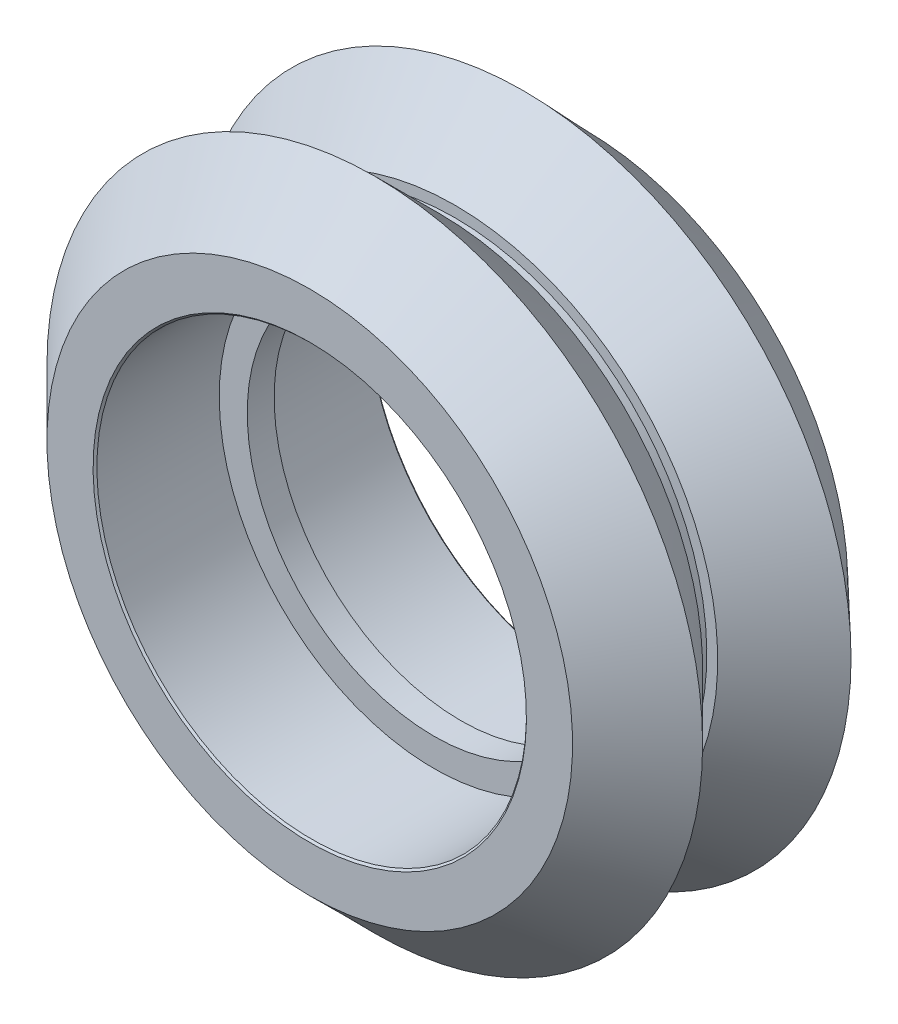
from build123d import *


with BuildPart() as part:
    # Sweep1: sweep along a path in Sketch4
    with BuildLine(Plane.XY) as sweep1_path:
        CenterArc((0, 0), 2.5, 0, 360)
    # Sketch3 → Sweep1 (sweep)
    with BuildSketch(Plane(origin=(0, 0, 0), x_dir=(0, 0, -1), z_dir=(1, 0, 0))):
        Polygon((-0.505, 6.945), (0.495, 6.945), (0.495, 7.987), (5.044289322, 7.987), (5.115, 8.057710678), (5.115, 9.77), (2.817453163, 12.18689992), (0.275, 9.77), (0.265, 9.375), (-0.285, 9.375), (-0.285, 9.77), (-2.706694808, 12.191694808), (-5.125, 9.773389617), (-5.125, 8.057710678), (-5.054289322, 7.987), (-0.505, 7.987), align=None)
    sweep(path=sweep1_path.line)


solid = part.part
